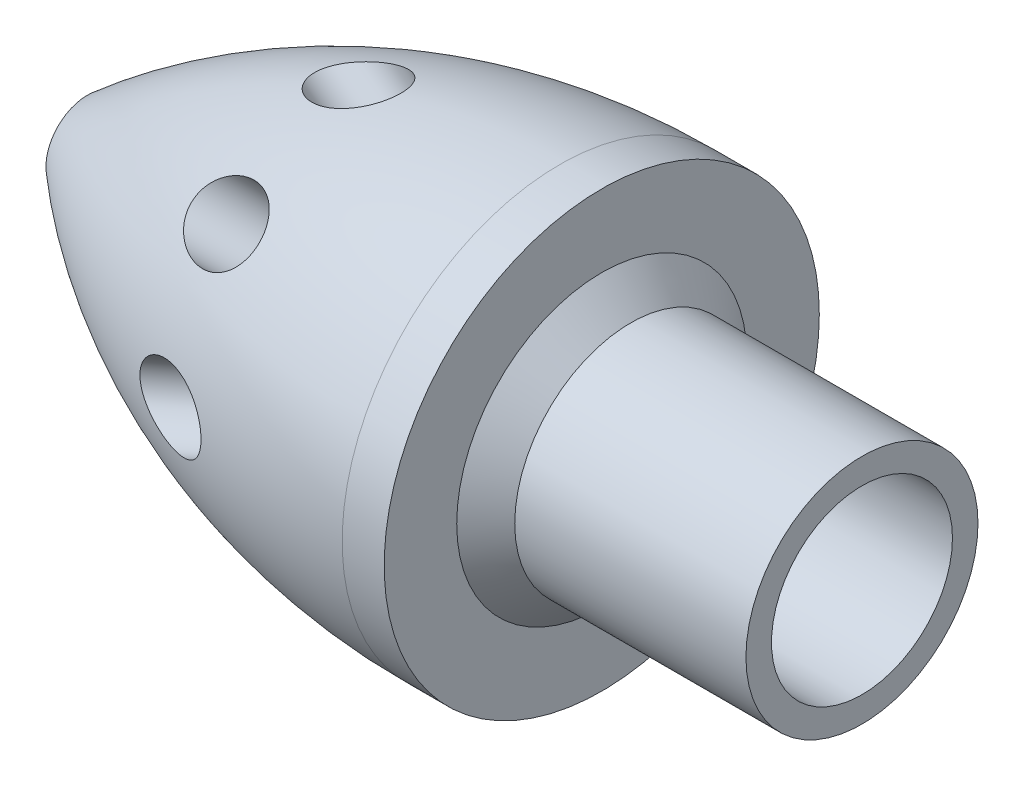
from build123d import *

# Parameters (mm, degrees)
SKETCH3_R          = 3.175
CUT_EXTRUDE1_DEPTH = 31.75
CIRPATTERN1_COUNT  = 8


with BuildPart() as part:
    # Sketch1 → Revolve1 (revolve)
    with BuildSketch(Plane.XY, mode=Mode.PRIVATE) as revolve1_sk:
        with BuildLine():
            Line((0, 19.05), (-3.680141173, 19.05))
            ThreePointArc((-3.680141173, 19.05), (-25.750242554, 15.069361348), (-45.038978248, 3.629101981))
            Line((-45.038978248, 3.629101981), (-45.038978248, 1.923944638))
            Line((-45.038978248, 1.923944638), (-14.169146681, 7.924432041))
            Line((-14.169146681, 7.924432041), (22.7838, 7.924432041))
            Line((22.7838, 7.924432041), (22.7838, 10.16))
            Line((22.7838, 10.16), (2.54, 10.16))
            Line((2.54, 10.16), (0, 12.7))
            Line((0, 12.7), (0, 19.05))
        make_face()
    revolve(revolve1_sk.sketch.rotate(Axis((0, 0, 0), (-1, 0, 0)), 90), axis=Axis((0, 0, 0), (-1, 0, 0)))

    # Sketch3 → Cut-Extrude1 (cut)
    with BuildSketch(Plane(origin=(-30.586329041, 23.469715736, 0), x_dir=(0, 0, 1), z_dir=(-0.7933533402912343, 0.6087614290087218, 0))):
        with Locations(Location((0, 0, 0), (0, 0, 264.512505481))):
            Circle(SKETCH3_R)
    cut_extrude1 = extrude(amount=-CUT_EXTRUDE1_DEPTH, mode=Mode.SUBTRACT)

    # CirPattern1: Cut-Extrude1 ×8 about axis
    cirpattern1_axis = Axis((0, 0, 0), (-1, 0, 0))
    for i in range(1, CIRPATTERN1_COUNT):
        add(cut_extrude1.rotate(cirpattern1_axis, i * 360 / CIRPATTERN1_COUNT), mode=Mode.SUBTRACT)


solid = part.part
